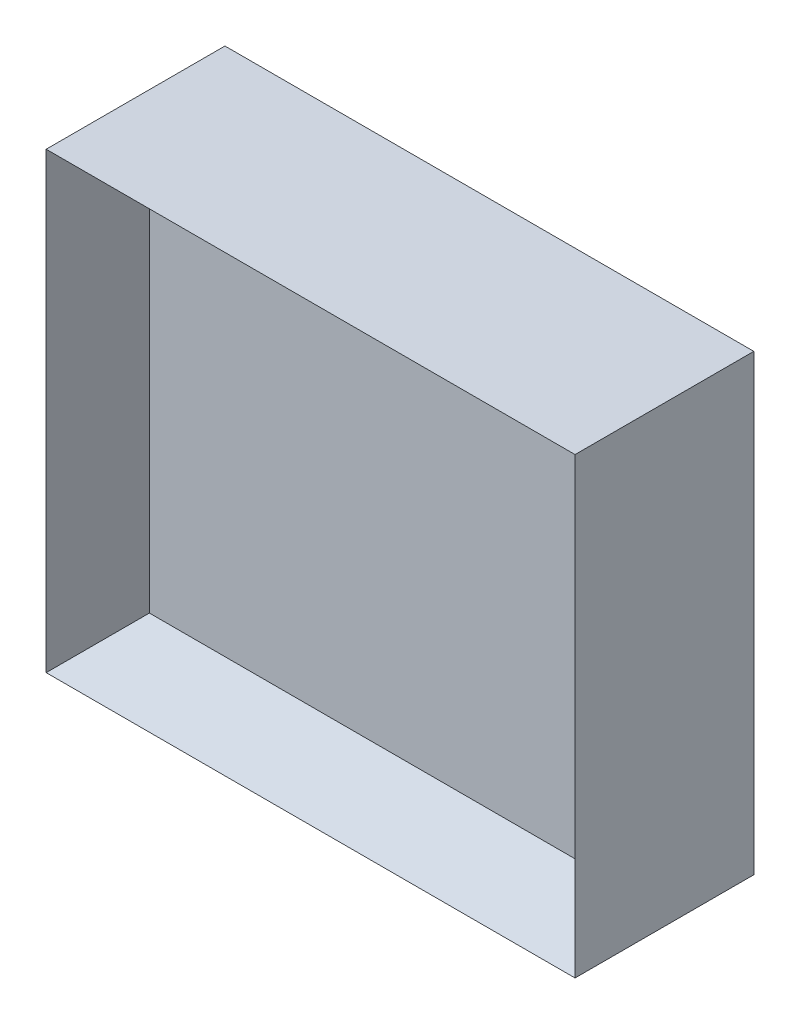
ISO-10303-21;
HEADER;
FILE_DESCRIPTION(('STEP AP214'),'2;1');
FILE_NAME('part.step','',(''),(''),'','','');
FILE_SCHEMA(('AUTOMOTIVE_DESIGN { 1 0 10303 214 1 1 1 1 }'));
ENDSEC;
DATA;
#1=APPLICATION_CONTEXT('core data for automotive mechanical design processes');
#2=APPLICATION_PROTOCOL_DEFINITION('international standard','automotive_design',2000,#1);
#3=PRODUCT_CONTEXT('',#1,'mechanical');
#4=PRODUCT('Part','Part','',(#3));
#5=PRODUCT_RELATED_PRODUCT_CATEGORY('part','',(#4));
#6=PRODUCT_DEFINITION_FORMATION('','',#4);
#7=PRODUCT_DEFINITION_CONTEXT('part definition',#1,'design');
#8=PRODUCT_DEFINITION('design','',#6,#7);
#9=PRODUCT_DEFINITION_SHAPE('','',#8);
#10=(LENGTH_UNIT() NAMED_UNIT(*) SI_UNIT(.MILLI.,.METRE.));
#11=(NAMED_UNIT(*) PLANE_ANGLE_UNIT() SI_UNIT($,.RADIAN.));
#12=(NAMED_UNIT(*) SI_UNIT($,.STERADIAN.) SOLID_ANGLE_UNIT());
#13=UNCERTAINTY_MEASURE_WITH_UNIT(LENGTH_MEASURE(1.E-05),#10,'distance_accuracy_value','');
#14=(GEOMETRIC_REPRESENTATION_CONTEXT(3) GLOBAL_UNCERTAINTY_ASSIGNED_CONTEXT((#13)) GLOBAL_UNIT_ASSIGNED_CONTEXT((#10,
#11,#12)) REPRESENTATION_CONTEXT('',''));
#15=CARTESIAN_POINT('',(0.,0.,0.));
#16=DIRECTION('',(0.,0.,1.));
#17=DIRECTION('',(1.,0.,0.));
#18=AXIS2_PLACEMENT_3D('',#15,#16,#17);
#19=CARTESIAN_POINT('',(-44.45,-38.1,19.05));
#20=DIRECTION('',(1.,0.,0.));
#21=DIRECTION('',(0.,0.,-1.));
#22=AXIS2_PLACEMENT_3D('',#19,#20,#21);
#23=PLANE('',#22);
#24=DIRECTION('',(0.,1.,0.));
#25=VECTOR('',#24,1.);
#26=CARTESIAN_POINT('',(-44.45,-38.1,10.9985226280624));
#27=LINE('',#26,#25);
#28=CARTESIAN_POINT('',(-44.45,38.1,10.9985226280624));
#29=VERTEX_POINT('',#28);
#30=CARTESIAN_POINT('',(-44.45,-38.1,10.9985226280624));
#31=VERTEX_POINT('',#30);
#32=EDGE_CURVE('E96',#29,#31,#27,.F.);
#33=ORIENTED_EDGE('',*,*,#32,.F.);
#34=DIRECTION('',(0.,0.,-1.));
#35=VECTOR('',#34,1.);
#36=CARTESIAN_POINT('',(-44.45,38.1,19.05));
#37=LINE('',#36,#35);
#38=CARTESIAN_POINT('',(-44.45,38.1,-19.05));
#39=VERTEX_POINT('',#38);
#40=EDGE_CURVE('E58',#29,#39,#37,.T.);
#41=ORIENTED_EDGE('',*,*,#40,.T.);
#42=DIRECTION('',(0.,-1.,0.));
#43=VECTOR('',#42,1.);
#44=CARTESIAN_POINT('',(-44.45,-38.1,-19.05));
#45=LINE('',#44,#43);
#46=CARTESIAN_POINT('',(-44.45,-38.1,-19.05));
#47=VERTEX_POINT('',#46);
#48=EDGE_CURVE('E126',#39,#47,#45,.T.);
#49=ORIENTED_EDGE('',*,*,#48,.T.);
#50=DIRECTION('',(0.,0.,-1.));
#51=VECTOR('',#50,1.);
#52=CARTESIAN_POINT('',(-44.45,-38.1,19.05));
#53=LINE('',#52,#51);
#54=EDGE_CURVE('E44',#31,#47,#53,.T.);
#55=ORIENTED_EDGE('',*,*,#54,.F.);
#56=EDGE_LOOP('',(#33,#41,#49,#55));
#57=FACE_BOUND('',#56,.T.);
#58=ADVANCED_FACE('F37',(#57),#23,.F.);
#59=CARTESIAN_POINT('',(44.45,-38.1,19.05));
#60=DIRECTION('',(0.,1.,0.));
#61=DIRECTION('',(-1.,0.,0.));
#62=AXIS2_PLACEMENT_3D('',#59,#60,#61);
#63=PLANE('',#62);
#64=DIRECTION('',(-1.,0.,0.));
#65=VECTOR('',#64,1.);
#66=CARTESIAN_POINT('',(44.45,-38.1,10.9985226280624));
#67=LINE('',#66,#65);
#68=CARTESIAN_POINT('',(44.45,-38.1,10.9985226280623));
#69=VERTEX_POINT('',#68);
#70=EDGE_CURVE('E124',#31,#69,#67,.F.);
#71=ORIENTED_EDGE('',*,*,#70,.F.);
#72=ORIENTED_EDGE('',*,*,#54,.T.);
#73=DIRECTION('',(1.,0.,0.));
#74=VECTOR('',#73,1.);
#75=CARTESIAN_POINT('',(44.45,-38.1,-19.05));
#76=LINE('',#75,#74);
#77=CARTESIAN_POINT('',(44.45,-38.1,-19.05));
#78=VERTEX_POINT('',#77);
#79=EDGE_CURVE('E128',#47,#78,#76,.T.);
#80=ORIENTED_EDGE('',*,*,#79,.T.);
#81=DIRECTION('',(0.,0.,-1.));
#82=VECTOR('',#81,1.);
#83=CARTESIAN_POINT('',(44.45,-38.1,19.05));
#84=LINE('',#83,#82);
#85=EDGE_CURVE('E139',#69,#78,#84,.T.);
#86=ORIENTED_EDGE('',*,*,#85,.F.);
#87=EDGE_LOOP('',(#71,#72,#80,#86));
#88=FACE_BOUND('',#87,.T.);
#89=ADVANCED_FACE('F143',(#88),#63,.F.);
#90=CARTESIAN_POINT('',(44.45,-38.1,19.05));
#91=DIRECTION('',(-1.,0.,0.));
#92=DIRECTION('',(0.,0.,1.));
#93=AXIS2_PLACEMENT_3D('',#90,#91,#92);
#94=PLANE('',#93);
#95=DIRECTION('',(0.,-1.,0.));
#96=VECTOR('',#95,1.);
#97=CARTESIAN_POINT('',(44.45,-38.1,10.9985226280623));
#98=LINE('',#97,#96);
#99=CARTESIAN_POINT('',(44.45,38.1,10.9985226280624));
#100=VERTEX_POINT('',#99);
#101=EDGE_CURVE('E99',#69,#100,#98,.F.);
#102=ORIENTED_EDGE('',*,*,#101,.F.);
#103=ORIENTED_EDGE('',*,*,#85,.T.);
#104=DIRECTION('',(0.,1.,0.));
#105=VECTOR('',#104,1.);
#106=CARTESIAN_POINT('',(44.45,-38.1,-19.05));
#107=LINE('',#106,#105);
#108=CARTESIAN_POINT('',(44.45,38.1,-19.05));
#109=VERTEX_POINT('',#108);
#110=EDGE_CURVE('E131',#78,#109,#107,.T.);
#111=ORIENTED_EDGE('',*,*,#110,.T.);
#112=DIRECTION('',(0.,0.,-1.));
#113=VECTOR('',#112,1.);
#114=CARTESIAN_POINT('',(44.45,38.1,19.05));
#115=LINE('',#114,#113);
#116=EDGE_CURVE('E137',#100,#109,#115,.T.);
#117=ORIENTED_EDGE('',*,*,#116,.F.);
#118=EDGE_LOOP('',(#102,#103,#111,#117));
#119=FACE_BOUND('',#118,.T.);
#120=ADVANCED_FACE('F154',(#119),#94,.F.);
#121=CARTESIAN_POINT('',(44.45,38.1,19.05));
#122=DIRECTION('',(0.,-1.,0.));
#123=DIRECTION('',(1.,0.,0.));
#124=AXIS2_PLACEMENT_3D('',#121,#122,#123);
#125=PLANE('',#124);
#126=DIRECTION('',(1.,0.,0.));
#127=VECTOR('',#126,1.);
#128=CARTESIAN_POINT('',(44.45,38.1,10.9985226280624));
#129=LINE('',#128,#127);
#130=EDGE_CURVE('E11',#100,#29,#129,.F.);
#131=ORIENTED_EDGE('',*,*,#130,.F.);
#132=ORIENTED_EDGE('',*,*,#116,.T.);
#133=DIRECTION('',(-1.,0.,0.));
#134=VECTOR('',#133,1.);
#135=CARTESIAN_POINT('',(44.45,38.1,-19.05));
#136=LINE('',#135,#134);
#137=EDGE_CURVE('E134',#109,#39,#136,.T.);
#138=ORIENTED_EDGE('',*,*,#137,.T.);
#139=ORIENTED_EDGE('',*,*,#40,.F.);
#140=EDGE_LOOP('',(#131,#132,#138,#139));
#141=FACE_BOUND('',#140,.T.);
#142=ADVANCED_FACE('F158',(#141),#125,.F.);
#143=CARTESIAN_POINT('',(0.,0.,-19.05));
#144=DIRECTION('',(0.,0.,1.));
#145=DIRECTION('',(1.,0.,0.));
#146=AXIS2_PLACEMENT_3D('',#143,#144,#145);
#147=PLANE('',#146);
#148=ORIENTED_EDGE('',*,*,#48,.F.);
#149=ORIENTED_EDGE('',*,*,#137,.F.);
#150=ORIENTED_EDGE('',*,*,#110,.F.);
#151=ORIENTED_EDGE('',*,*,#79,.F.);
#152=EDGE_LOOP('',(#148,#149,#150,#151));
#153=FACE_BOUND('',#152,.T.);
#154=ADVANCED_FACE('F148',(#153),#147,.F.);
#155=CARTESIAN_POINT('',(38.1,-31.75,0.));
#156=DIRECTION('',(0.,-0.866025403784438,-0.5));
#157=DIRECTION('',(0.,0.5,-0.866025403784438));
#158=AXIS2_PLACEMENT_3D('',#155,#156,#157);
#159=PLANE('',#158);
#160=ORIENTED_EDGE('',*,*,#70,.T.);
#161=DIRECTION('',(-0.447213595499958,0.447213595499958,-0.774596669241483));
#162=VECTOR('',#161,1.);
#163=CARTESIAN_POINT('',(25.4,-19.05,-21.9970452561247));
#164=LINE('',#163,#162);
#165=CARTESIAN_POINT('',(38.1,-31.75,0.));
#166=VERTEX_POINT('',#165);
#167=EDGE_CURVE('E100',#69,#166,#164,.T.);
#168=ORIENTED_EDGE('',*,*,#167,.T.);
#169=DIRECTION('',(1.,0.,0.));
#170=VECTOR('',#169,1.);
#171=CARTESIAN_POINT('',(38.1,-31.75,0.));
#172=LINE('',#171,#170);
#173=CARTESIAN_POINT('',(-38.1,-31.75,0.));
#174=VERTEX_POINT('',#173);
#175=EDGE_CURVE('E103',#174,#166,#172,.T.);
#176=ORIENTED_EDGE('',*,*,#175,.F.);
#177=DIRECTION('',(0.447213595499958,0.447213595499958,-0.774596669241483));
#178=VECTOR('',#177,1.);
#179=CARTESIAN_POINT('',(-22.86,-16.51,-26.3964543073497));
#180=LINE('',#179,#178);
#181=EDGE_CURVE('E90',#31,#174,#180,.T.);
#182=ORIENTED_EDGE('',*,*,#181,.F.);
#183=EDGE_LOOP('',(#160,#168,#176,#182));
#184=FACE_BOUND('',#183,.T.);
#185=ADVANCED_FACE('F104',(#184),#159,.F.);
#186=CARTESIAN_POINT('',(-38.1,31.75,0.));
#187=DIRECTION('',(-0.866025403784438,0.,-0.5));
#188=DIRECTION('',(-0.5,0.,0.866025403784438));
#189=AXIS2_PLACEMENT_3D('',#186,#187,#188);
#190=PLANE('',#189);
#191=ORIENTED_EDGE('',*,*,#32,.T.);
#192=ORIENTED_EDGE('',*,*,#181,.T.);
#193=DIRECTION('',(0.,-1.,0.));
#194=VECTOR('',#193,1.);
#195=CARTESIAN_POINT('',(-38.1,31.75,0.));
#196=LINE('',#195,#194);
#197=CARTESIAN_POINT('',(-38.1,31.75,0.));
#198=VERTEX_POINT('',#197);
#199=EDGE_CURVE('E95',#198,#174,#196,.T.);
#200=ORIENTED_EDGE('',*,*,#199,.F.);
#201=DIRECTION('',(0.447213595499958,-0.447213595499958,-0.774596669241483));
#202=VECTOR('',#201,1.);
#203=CARTESIAN_POINT('',(-38.1,31.75,0.));
#204=LINE('',#203,#202);
#205=EDGE_CURVE('E117',#29,#198,#204,.T.);
#206=ORIENTED_EDGE('',*,*,#205,.F.);
#207=EDGE_LOOP('',(#191,#192,#200,#206));
#208=FACE_BOUND('',#207,.T.);
#209=ADVANCED_FACE('F92',(#208),#190,.F.);
#210=CARTESIAN_POINT('',(38.1,31.75,0.));
#211=DIRECTION('',(0.866025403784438,0.,-0.5));
#212=DIRECTION('',(-0.5,0.,-0.866025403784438));
#213=AXIS2_PLACEMENT_3D('',#210,#211,#212);
#214=PLANE('',#213);
#215=ORIENTED_EDGE('',*,*,#101,.T.);
#216=DIRECTION('',(-0.447213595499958,-0.447213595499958,-0.774596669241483));
#217=VECTOR('',#216,1.);
#218=CARTESIAN_POINT('',(38.1,31.75,0.));
#219=LINE('',#218,#217);
#220=CARTESIAN_POINT('',(38.1,31.75,0.));
#221=VERTEX_POINT('',#220);
#222=EDGE_CURVE('E50',#100,#221,#219,.T.);
#223=ORIENTED_EDGE('',*,*,#222,.T.);
#224=DIRECTION('',(0.,1.,0.));
#225=VECTOR('',#224,1.);
#226=CARTESIAN_POINT('',(38.1,31.75,0.));
#227=LINE('',#226,#225);
#228=EDGE_CURVE('E109',#166,#221,#227,.T.);
#229=ORIENTED_EDGE('',*,*,#228,.F.);
#230=ORIENTED_EDGE('',*,*,#167,.F.);
#231=EDGE_LOOP('',(#215,#223,#229,#230));
#232=FACE_BOUND('',#231,.T.);
#233=ADVANCED_FACE('F169',(#232),#214,.F.);
#234=CARTESIAN_POINT('',(38.1,31.75,0.));
#235=DIRECTION('',(0.,0.866025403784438,-0.5));
#236=DIRECTION('',(0.,0.5,0.866025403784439));
#237=AXIS2_PLACEMENT_3D('',#234,#235,#236);
#238=PLANE('',#237);
#239=ORIENTED_EDGE('',*,*,#130,.T.);
#240=ORIENTED_EDGE('',*,*,#205,.T.);
#241=DIRECTION('',(-1.,0.,0.));
#242=VECTOR('',#241,1.);
#243=CARTESIAN_POINT('',(38.1,31.75,0.));
#244=LINE('',#243,#242);
#245=EDGE_CURVE('E113',#221,#198,#244,.T.);
#246=ORIENTED_EDGE('',*,*,#245,.F.);
#247=ORIENTED_EDGE('',*,*,#222,.F.);
#248=EDGE_LOOP('',(#239,#240,#246,#247));
#249=FACE_BOUND('',#248,.T.);
#250=ADVANCED_FACE('F172',(#249),#238,.F.);
#251=CARTESIAN_POINT('',(0.,0.,0.));
#252=DIRECTION('',(0.,0.,-1.));
#253=DIRECTION('',(-1.,0.,0.));
#254=AXIS2_PLACEMENT_3D('',#251,#252,#253);
#255=PLANE('',#254);
#256=ORIENTED_EDGE('',*,*,#199,.T.);
#257=ORIENTED_EDGE('',*,*,#175,.T.);
#258=ORIENTED_EDGE('',*,*,#228,.T.);
#259=ORIENTED_EDGE('',*,*,#245,.T.);
#260=EDGE_LOOP('',(#256,#257,#258,#259));
#261=FACE_BOUND('',#260,.T.);
#262=ADVANCED_FACE('F112',(#261),#255,.F.);
#263=CLOSED_SHELL('',(#58,#89,#120,#142,#154,#185,#209,#233,#250,#262));
#264=MANIFOLD_SOLID_BREP('B2',#263);
#265=ADVANCED_BREP_SHAPE_REPRESENTATION('',(#18,#264),#14);
#266=SHAPE_DEFINITION_REPRESENTATION(#9,#265);
ENDSEC;
END-ISO-10303-21;
